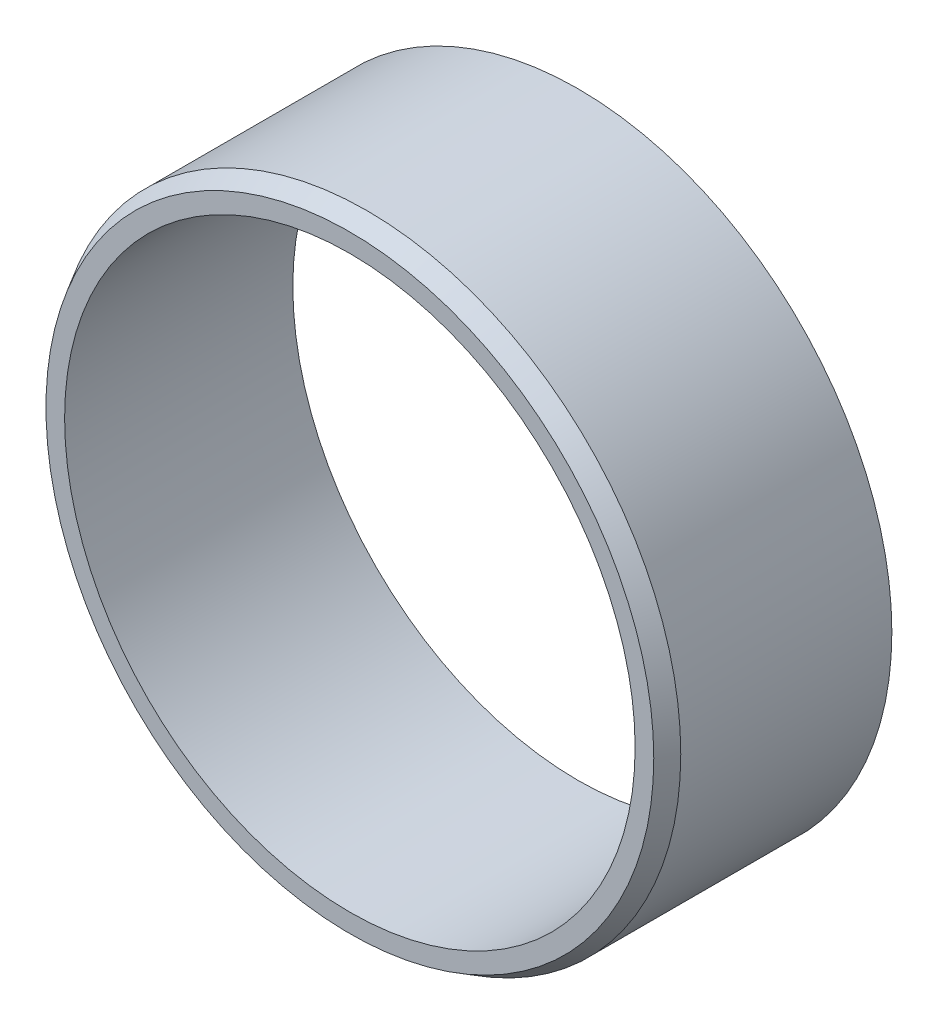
ISO-10303-21;
HEADER;
FILE_DESCRIPTION(('STEP AP214'),'2;1');
FILE_NAME('part.step','',(''),(''),'','','');
FILE_SCHEMA(('AUTOMOTIVE_DESIGN { 1 0 10303 214 1 1 1 1 }'));
ENDSEC;
DATA;
#1=APPLICATION_CONTEXT('core data for automotive mechanical design processes');
#2=APPLICATION_PROTOCOL_DEFINITION('international standard','automotive_design',2000,#1);
#3=PRODUCT_CONTEXT('',#1,'mechanical');
#4=PRODUCT('Part','Part','',(#3));
#5=PRODUCT_RELATED_PRODUCT_CATEGORY('part','',(#4));
#6=PRODUCT_DEFINITION_FORMATION('','',#4);
#7=PRODUCT_DEFINITION_CONTEXT('part definition',#1,'design');
#8=PRODUCT_DEFINITION('design','',#6,#7);
#9=PRODUCT_DEFINITION_SHAPE('','',#8);
#10=(LENGTH_UNIT() NAMED_UNIT(*) SI_UNIT(.MILLI.,.METRE.));
#11=(NAMED_UNIT(*) PLANE_ANGLE_UNIT() SI_UNIT($,.RADIAN.));
#12=(NAMED_UNIT(*) SI_UNIT($,.STERADIAN.) SOLID_ANGLE_UNIT());
#13=UNCERTAINTY_MEASURE_WITH_UNIT(LENGTH_MEASURE(1.E-05),#10,'distance_accuracy_value','');
#14=(GEOMETRIC_REPRESENTATION_CONTEXT(3) GLOBAL_UNCERTAINTY_ASSIGNED_CONTEXT((#13)) GLOBAL_UNIT_ASSIGNED_CONTEXT((#10,
#11,#12)) REPRESENTATION_CONTEXT('',''));
#15=CARTESIAN_POINT('',(0.,0.,0.));
#16=DIRECTION('',(0.,0.,1.));
#17=DIRECTION('',(1.,0.,0.));
#18=AXIS2_PLACEMENT_3D('',#15,#16,#17);
#19=CARTESIAN_POINT('',(0.,0.,-40.));
#20=DIRECTION('',(0.,0.,1.));
#21=DIRECTION('',(1.,0.,0.));
#22=AXIS2_PLACEMENT_3D('',#19,#20,#21);
#23=CYLINDRICAL_SURFACE('',#22,22.);
#24=CARTESIAN_POINT('',(0.,0.,-1.20000000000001));
#25=DIRECTION('',(0.,0.,1.));
#26=DIRECTION('',(1.,0.,0.));
#27=AXIS2_PLACEMENT_3D('',#24,#25,#26);
#28=CIRCLE('',#27,22.);
#29=CARTESIAN_POINT('',(22.,0.,-1.20000000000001));
#30=VERTEX_POINT('',#29);
#31=EDGE_CURVE('E10',#30,#30,#28,.F.);
#32=ORIENTED_EDGE('',*,*,#31,.T.);
#33=EDGE_LOOP('',(#32));
#34=FACE_BOUND('',#33,.T.);
#35=CARTESIAN_POINT('',(0.,0.,-16.));
#36=DIRECTION('',(0.,0.,1.));
#37=DIRECTION('',(1.,0.,0.));
#38=AXIS2_PLACEMENT_3D('',#35,#36,#37);
#39=CIRCLE('',#38,22.);
#40=CARTESIAN_POINT('',(22.,0.,-16.));
#41=VERTEX_POINT('',#40);
#42=EDGE_CURVE('E362',#41,#41,#39,.T.);
#43=ORIENTED_EDGE('',*,*,#42,.T.);
#44=EDGE_LOOP('',(#43));
#45=FACE_BOUND('',#44,.T.);
#46=ADVANCED_FACE('F346',(#34,#45),#23,.T.);
#47=CARTESIAN_POINT('',(0.,0.,-40.));
#48=DIRECTION('',(0.,0.,1.));
#49=DIRECTION('',(1.,0.,0.));
#50=AXIS2_PLACEMENT_3D('',#47,#48,#49);
#51=CYLINDRICAL_SURFACE('',#50,20.);
#52=CARTESIAN_POINT('',(0.,0.,0.));
#53=DIRECTION('',(0.,0.,1.));
#54=DIRECTION('',(1.,0.,0.));
#55=AXIS2_PLACEMENT_3D('',#52,#53,#54);
#56=CIRCLE('',#55,20.);
#57=CARTESIAN_POINT('',(20.,0.,0.));
#58=VERTEX_POINT('',#57);
#59=EDGE_CURVE('E357',#58,#58,#56,.T.);
#60=ORIENTED_EDGE('',*,*,#59,.T.);
#61=EDGE_LOOP('',(#60));
#62=FACE_BOUND('',#61,.T.);
#63=CARTESIAN_POINT('',(0.,0.,-16.));
#64=DIRECTION('',(0.,0.,-1.));
#65=DIRECTION('',(-1.,0.,0.));
#66=AXIS2_PLACEMENT_3D('',#63,#64,#65);
#67=CIRCLE('',#66,20.);
#68=CARTESIAN_POINT('',(-20.,0.,-16.));
#69=VERTEX_POINT('',#68);
#70=EDGE_CURVE('E349',#69,#69,#67,.F.);
#71=ORIENTED_EDGE('',*,*,#70,.F.);
#72=EDGE_LOOP('',(#71));
#73=FACE_BOUND('',#72,.T.);
#74=ADVANCED_FACE('F371',(#62,#73),#51,.F.);
#75=CARTESIAN_POINT('',(0.,0.,0.));
#76=DIRECTION('',(0.,0.,1.));
#77=DIRECTION('',(1.,0.,0.));
#78=AXIS2_PLACEMENT_3D('',#75,#76,#77);
#79=PLANE('',#78);
#80=CARTESIAN_POINT('',(0.,0.,0.));
#81=DIRECTION('',(0.,0.,1.));
#82=DIRECTION('',(1.,0.,0.));
#83=AXIS2_PLACEMENT_3D('',#80,#81,#82);
#84=CIRCLE('',#83,21.3071796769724);
#85=CARTESIAN_POINT('',(21.3071796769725,0.,0.));
#86=VERTEX_POINT('',#85);
#87=EDGE_CURVE('E353',#86,#86,#84,.T.);
#88=ORIENTED_EDGE('',*,*,#87,.T.);
#89=EDGE_LOOP('',(#88));
#90=FACE_BOUND('',#89,.T.);
#91=ORIENTED_EDGE('',*,*,#59,.F.);
#92=EDGE_LOOP('',(#91));
#93=FACE_BOUND('',#92,.T.);
#94=ADVANCED_FACE('F373',(#90,#93),#79,.T.);
#95=CARTESIAN_POINT('',(0.,0.,0.));
#96=DIRECTION('',(0.,0.,-1.));
#97=DIRECTION('',(-1.,0.,0.));
#98=AXIS2_PLACEMENT_3D('',#95,#96,#97);
#99=CONICAL_SURFACE('',#98,21.3071796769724,0.523598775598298);
#100=ORIENTED_EDGE('',*,*,#31,.F.);
#101=EDGE_LOOP('',(#100));
#102=FACE_BOUND('',#101,.T.);
#103=ORIENTED_EDGE('',*,*,#87,.F.);
#104=EDGE_LOOP('',(#103));
#105=FACE_BOUND('',#104,.T.);
#106=ADVANCED_FACE('F380',(#102,#105),#99,.T.);
#107=CARTESIAN_POINT('',(0.,22.,-16.));
#108=DIRECTION('',(0.,0.,-1.));
#109=DIRECTION('',(-1.,0.,0.));
#110=AXIS2_PLACEMENT_3D('',#107,#108,#109);
#111=PLANE('',#110);
#112=ORIENTED_EDGE('',*,*,#42,.F.);
#113=EDGE_LOOP('',(#112));
#114=FACE_BOUND('',#113,.T.);
#115=ORIENTED_EDGE('',*,*,#70,.T.);
#116=EDGE_LOOP('',(#115));
#117=FACE_BOUND('',#116,.T.);
#118=ADVANCED_FACE('F369',(#114,#117),#111,.T.);
#119=CLOSED_SHELL('',(#46,#74,#94,#106,#118));
#120=MANIFOLD_SOLID_BREP('B2',#119);
#121=ADVANCED_BREP_SHAPE_REPRESENTATION('',(#18,#120),#14);
#122=SHAPE_DEFINITION_REPRESENTATION(#9,#121);
ENDSEC;
END-ISO-10303-21;
